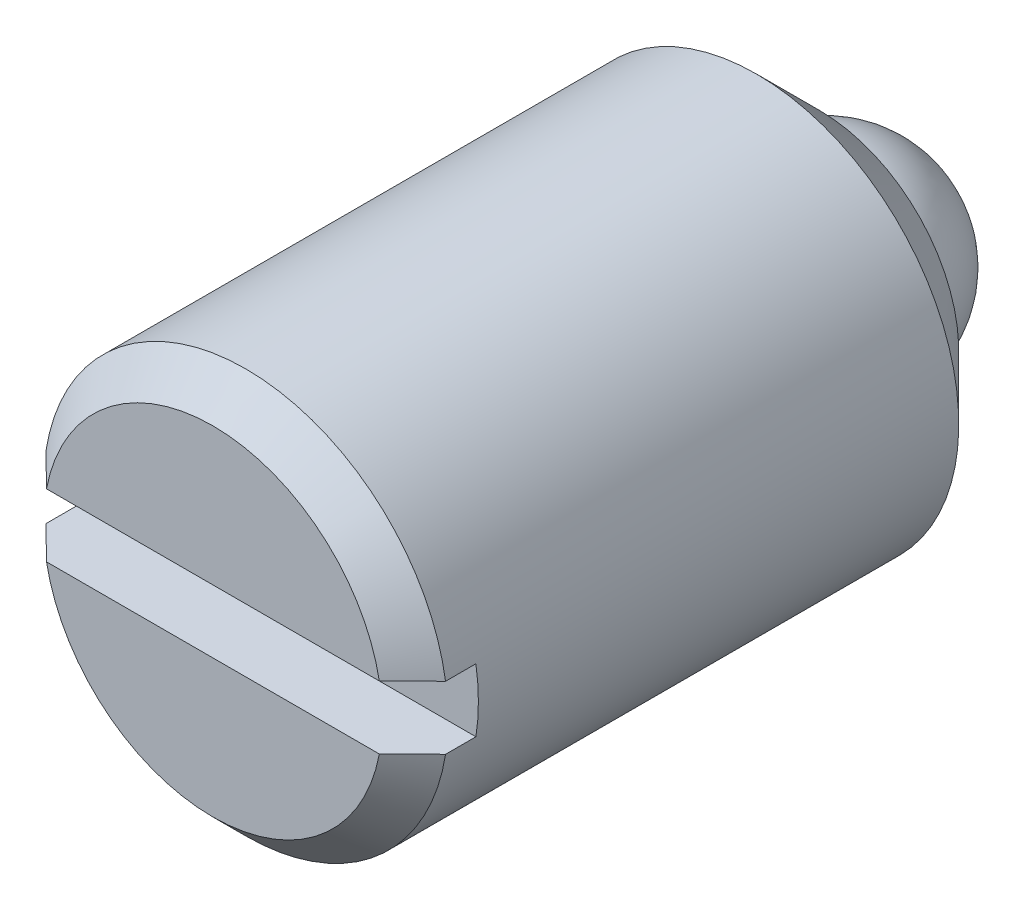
ISO-10303-21;
HEADER;
FILE_DESCRIPTION(('STEP AP214'),'2;1');
FILE_NAME('part.step','',(''),(''),'','','');
FILE_SCHEMA(('AUTOMOTIVE_DESIGN { 1 0 10303 214 1 1 1 1 }'));
ENDSEC;
DATA;
#1=APPLICATION_CONTEXT('core data for automotive mechanical design processes');
#2=APPLICATION_PROTOCOL_DEFINITION('international standard','automotive_design',2000,#1);
#3=PRODUCT_CONTEXT('',#1,'mechanical');
#4=PRODUCT('Part','Part','',(#3));
#5=PRODUCT_RELATED_PRODUCT_CATEGORY('part','',(#4));
#6=PRODUCT_DEFINITION_FORMATION('','',#4);
#7=PRODUCT_DEFINITION_CONTEXT('part definition',#1,'design');
#8=PRODUCT_DEFINITION('design','',#6,#7);
#9=PRODUCT_DEFINITION_SHAPE('','',#8);
#10=(LENGTH_UNIT() NAMED_UNIT(*) SI_UNIT(.MILLI.,.METRE.));
#11=(NAMED_UNIT(*) PLANE_ANGLE_UNIT() SI_UNIT($,.RADIAN.));
#12=(NAMED_UNIT(*) SI_UNIT($,.STERADIAN.) SOLID_ANGLE_UNIT());
#13=UNCERTAINTY_MEASURE_WITH_UNIT(LENGTH_MEASURE(1.E-05),#10,'distance_accuracy_value','');
#14=(GEOMETRIC_REPRESENTATION_CONTEXT(3) GLOBAL_UNCERTAINTY_ASSIGNED_CONTEXT((#13)) GLOBAL_UNIT_ASSIGNED_CONTEXT((#10,
#11,#12)) REPRESENTATION_CONTEXT('',''));
#15=CARTESIAN_POINT('',(0.,0.,0.));
#16=DIRECTION('',(0.,0.,1.));
#17=DIRECTION('',(1.,0.,0.));
#18=AXIS2_PLACEMENT_3D('',#15,#16,#17);
#19=CARTESIAN_POINT('',(0.,8.,28.5));
#20=DIRECTION('',(0.,0.,1.));
#21=DIRECTION('',(1.,0.,0.));
#22=AXIS2_PLACEMENT_3D('',#19,#20,#21);
#23=PLANE('',#22);
#24=DIRECTION('',(1.,0.,0.));
#25=VECTOR('',#24,1.);
#26=CARTESIAN_POINT('',(-7.90174031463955,1.25,28.5));
#27=LINE('',#26,#25);
#28=CARTESIAN_POINT('',(-6.5823627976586,1.25,28.5));
#29=VERTEX_POINT('',#28);
#30=CARTESIAN_POINT('',(6.5823627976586,1.25,28.5));
#31=VERTEX_POINT('',#30);
#32=EDGE_CURVE('E86',#29,#31,#27,.T.);
#33=ORIENTED_EDGE('',*,*,#32,.T.);
#34=CARTESIAN_POINT('',(0.,0.,28.5));
#35=DIRECTION('',(0.,0.,1.));
#36=DIRECTION('',(1.,0.,0.));
#37=AXIS2_PLACEMENT_3D('',#34,#35,#36);
#38=CIRCLE('',#37,6.7);
#39=EDGE_CURVE('E160',#31,#29,#38,.T.);
#40=ORIENTED_EDGE('',*,*,#39,.T.);
#41=EDGE_LOOP('',(#33,#40));
#42=FACE_BOUND('',#41,.T.);
#43=ADVANCED_FACE('F14',(#42),#23,.T.);
#44=CARTESIAN_POINT('',(0.,0.,-3.5));
#45=DIRECTION('',(0.,0.,-1.));
#46=DIRECTION('',(-1.,0.,0.));
#47=AXIS2_PLACEMENT_3D('',#44,#45,#46);
#48=CYLINDRICAL_SURFACE('',#47,8.);
#49=DIRECTION('',(0.,0.,1.));
#50=VECTOR('',#49,1.);
#51=CARTESIAN_POINT('',(7.90174031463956,-1.25,26.5));
#52=LINE('',#51,#50);
#53=CARTESIAN_POINT('',(7.90174031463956,-1.25,26.));
#54=VERTEX_POINT('',#53);
#55=CARTESIAN_POINT('',(7.90174031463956,-1.25,27.2));
#56=VERTEX_POINT('',#55);
#57=EDGE_CURVE('E85',#54,#56,#52,.T.);
#58=ORIENTED_EDGE('',*,*,#57,.T.);
#59=CARTESIAN_POINT('',(0.,0.,27.2));
#60=DIRECTION('',(0.,0.,1.));
#61=DIRECTION('',(1.,0.,0.));
#62=AXIS2_PLACEMENT_3D('',#59,#60,#61);
#63=CIRCLE('',#62,8.);
#64=CARTESIAN_POINT('',(-7.90174031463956,-1.25,27.2));
#65=VERTEX_POINT('',#64);
#66=EDGE_CURVE('E82',#56,#65,#63,.F.);
#67=ORIENTED_EDGE('',*,*,#66,.T.);
#68=DIRECTION('',(0.,0.,1.));
#69=VECTOR('',#68,1.);
#70=CARTESIAN_POINT('',(-7.90174031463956,-1.25,26.5));
#71=LINE('',#70,#69);
#72=CARTESIAN_POINT('',(-7.90174031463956,-1.25,26.));
#73=VERTEX_POINT('',#72);
#74=EDGE_CURVE('E73',#73,#65,#71,.T.);
#75=ORIENTED_EDGE('',*,*,#74,.F.);
#76=CARTESIAN_POINT('',(0.,0.,26.));
#77=DIRECTION('',(0.,0.,1.));
#78=DIRECTION('',(0.,-1.,0.));
#79=AXIS2_PLACEMENT_3D('',#76,#77,#78);
#80=CIRCLE('',#79,8.);
#81=CARTESIAN_POINT('',(-7.90174031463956,1.25,26.));
#82=VERTEX_POINT('',#81);
#83=EDGE_CURVE('E80',#82,#73,#80,.T.);
#84=ORIENTED_EDGE('',*,*,#83,.F.);
#85=DIRECTION('',(0.,0.,1.));
#86=VECTOR('',#85,1.);
#87=CARTESIAN_POINT('',(-7.90174031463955,1.25,26.5));
#88=LINE('',#87,#86);
#89=CARTESIAN_POINT('',(-7.90174031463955,1.25,27.2));
#90=VERTEX_POINT('',#89);
#91=EDGE_CURVE('E111',#82,#90,#88,.T.);
#92=ORIENTED_EDGE('',*,*,#91,.T.);
#93=CARTESIAN_POINT('',(0.,0.,27.2));
#94=DIRECTION('',(0.,0.,1.));
#95=DIRECTION('',(1.,0.,0.));
#96=AXIS2_PLACEMENT_3D('',#93,#94,#95);
#97=CIRCLE('',#96,8.);
#98=CARTESIAN_POINT('',(7.90174031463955,1.25,27.2));
#99=VERTEX_POINT('',#98);
#100=EDGE_CURVE('E162',#90,#99,#97,.F.);
#101=ORIENTED_EDGE('',*,*,#100,.T.);
#102=DIRECTION('',(0.,0.,1.));
#103=VECTOR('',#102,1.);
#104=CARTESIAN_POINT('',(7.90174031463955,1.25,26.5));
#105=LINE('',#104,#103);
#106=CARTESIAN_POINT('',(7.90174031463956,1.25,26.));
#107=VERTEX_POINT('',#106);
#108=EDGE_CURVE('E109',#107,#99,#105,.T.);
#109=ORIENTED_EDGE('',*,*,#108,.F.);
#110=CARTESIAN_POINT('',(0.,0.,26.));
#111=DIRECTION('',(0.,0.,1.));
#112=DIRECTION('',(0.,-1.,0.));
#113=AXIS2_PLACEMENT_3D('',#110,#111,#112);
#114=CIRCLE('',#113,8.);
#115=EDGE_CURVE('E95',#54,#107,#114,.T.);
#116=ORIENTED_EDGE('',*,*,#115,.F.);
#117=EDGE_LOOP('',(#58,#67,#75,#84,#92,#101,#109,#116));
#118=FACE_BOUND('',#117,.T.);
#119=CARTESIAN_POINT('',(0.,0.,7.));
#120=DIRECTION('',(0.,0.,-1.));
#121=DIRECTION('',(0.,1.,0.));
#122=AXIS2_PLACEMENT_3D('',#119,#120,#121);
#123=CIRCLE('',#122,8.);
#124=CARTESIAN_POINT('',(0.,8.,7.));
#125=VERTEX_POINT('',#124);
#126=EDGE_CURVE('E122',#125,#125,#123,.F.);
#127=ORIENTED_EDGE('',*,*,#126,.T.);
#128=EDGE_LOOP('',(#127));
#129=FACE_BOUND('',#128,.T.);
#130=ADVANCED_FACE('F76',(#118,#129),#48,.T.);
#131=CARTESIAN_POINT('',(0.,4.25,4.5));
#132=DIRECTION('',(0.,0.,-1.));
#133=DIRECTION('',(-1.,0.,0.));
#134=AXIS2_PLACEMENT_3D('',#131,#132,#133);
#135=PLANE('',#134);
#136=CARTESIAN_POINT('',(0.,0.,4.5));
#137=DIRECTION('',(0.,0.,-1.));
#138=DIRECTION('',(0.,1.,0.));
#139=AXIS2_PLACEMENT_3D('',#136,#137,#138);
#140=CIRCLE('',#139,5.5);
#141=CARTESIAN_POINT('',(0.,5.5,4.5));
#142=VERTEX_POINT('',#141);
#143=EDGE_CURVE('E119',#142,#142,#140,.T.);
#144=ORIENTED_EDGE('',*,*,#143,.T.);
#145=EDGE_LOOP('',(#144));
#146=FACE_BOUND('',#145,.T.);
#147=CARTESIAN_POINT('',(0.,0.,4.5));
#148=DIRECTION('',(0.,0.,-1.));
#149=DIRECTION('',(-1.,0.,0.));
#150=AXIS2_PLACEMENT_3D('',#147,#148,#149);
#151=CIRCLE('',#150,4.25);
#152=CARTESIAN_POINT('',(-4.25,0.,4.5));
#153=VERTEX_POINT('',#152);
#154=EDGE_CURVE('E116',#153,#153,#151,.T.);
#155=ORIENTED_EDGE('',*,*,#154,.F.);
#156=EDGE_LOOP('',(#155));
#157=FACE_BOUND('',#156,.T.);
#158=ADVANCED_FACE('F183',(#146,#157),#135,.T.);
#159=CARTESIAN_POINT('',(0.,0.,-3.5));
#160=DIRECTION('',(0.,0.,-1.));
#161=DIRECTION('',(-1.,0.,0.));
#162=AXIS2_PLACEMENT_3D('',#159,#160,#161);
#163=CYLINDRICAL_SURFACE('',#162,4.25);
#164=CARTESIAN_POINT('',(0.,0.,4.25));
#165=DIRECTION('',(0.,0.,-1.));
#166=DIRECTION('',(-1.,0.,0.));
#167=AXIS2_PLACEMENT_3D('',#164,#165,#166);
#168=CIRCLE('',#167,4.25);
#169=CARTESIAN_POINT('',(-4.25,0.,4.25));
#170=VERTEX_POINT('',#169);
#171=EDGE_CURVE('E113',#170,#170,#168,.T.);
#172=ORIENTED_EDGE('',*,*,#171,.F.);
#173=EDGE_LOOP('',(#172));
#174=FACE_BOUND('',#173,.T.);
#175=ORIENTED_EDGE('',*,*,#154,.T.);
#176=EDGE_LOOP('',(#175));
#177=FACE_BOUND('',#176,.T.);
#178=ADVANCED_FACE('F174',(#174,#177),#163,.T.);
#179=CARTESIAN_POINT('',(0.,0.,4.25));
#180=DIRECTION('',(-1.,0.,0.));
#181=DIRECTION('',(0.,0.,1.));
#182=AXIS2_PLACEMENT_3D('',#179,#180,#181);
#183=SPHERICAL_SURFACE('',#182,4.25);
#184=CARTESIAN_POINT('',(0.,0.,4.25));
#185=DIRECTION('',(0.,0.,-1.));
#186=DIRECTION('',(-1.,0.,0.));
#187=AXIS2_PLACEMENT_3D('',#184,#185,#186);
#188=SPHERICAL_SURFACE('',#187,4.25);
#189=ORIENTED_EDGE('',*,*,#171,.T.);
#190=EDGE_LOOP('',(#189));
#191=FACE_BOUND('',#190,.T.);
#192=ADVANCED_FACE('F168',(#191),#188,.T.);
#193=DIRECTION('',(1.,0.,0.));
#194=VECTOR('',#193,1.);
#195=CARTESIAN_POINT('',(-7.90174031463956,-1.25,28.5));
#196=LINE('',#195,#194);
#197=CARTESIAN_POINT('',(-6.58236279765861,-1.25,28.5));
#198=VERTEX_POINT('',#197);
#199=CARTESIAN_POINT('',(6.5823627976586,-1.25,28.5));
#200=VERTEX_POINT('',#199);
#201=EDGE_CURVE('E105',#198,#200,#196,.T.);
#202=ORIENTED_EDGE('',*,*,#201,.F.);
#203=CARTESIAN_POINT('',(0.,0.,28.5));
#204=DIRECTION('',(0.,0.,1.));
#205=DIRECTION('',(1.,0.,0.));
#206=AXIS2_PLACEMENT_3D('',#203,#204,#205);
#207=CIRCLE('',#206,6.7);
#208=EDGE_CURVE('E125',#198,#200,#207,.T.);
#209=ORIENTED_EDGE('',*,*,#208,.T.);
#210=EDGE_LOOP('',(#202,#209));
#211=FACE_BOUND('',#210,.T.);
#212=ADVANCED_FACE('F152',(#211),#23,.T.);
#213=CARTESIAN_POINT('',(-7.90174031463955,1.25,26.5));
#214=DIRECTION('',(0.,-1.,0.));
#215=DIRECTION('',(1.,0.,0.));
#216=AXIS2_PLACEMENT_3D('',#213,#214,#215);
#217=PLANE('',#216);
#218=ORIENTED_EDGE('',*,*,#32,.F.);
#219=CARTESIAN_POINT('',(-6.5823627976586,1.25,28.5));
#220=CARTESIAN_POINT('',(-6.69246825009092,1.25,28.3918264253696));
#221=CARTESIAN_POINT('',(-6.80252765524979,1.25,28.2836060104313));
#222=CARTESIAN_POINT('',(-7.02256440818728,1.25,28.0670818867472));
#223=CARTESIAN_POINT('',(-7.13254175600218,1.25,27.9587781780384));
#224=CARTESIAN_POINT('',(-7.46236593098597,1.25,27.6337575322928));
#225=CARTESIAN_POINT('',(-7.68210487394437,1.25,27.4169310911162));
#226=CARTESIAN_POINT('',(-7.90174031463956,1.25,27.2));
#227=B_SPLINE_CURVE_WITH_KNOTS('',3,(#219,#220,#221,#222,#223,#224,#225,#226),.UNSPECIFIED.,.F.,
.F.,(4,2,2,4),(0.,0.463057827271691,0.926115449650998,1.85223076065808),.UNSPECIFIED.);
#228=EDGE_CURVE('E9',#29,#90,#227,.T.);
#229=ORIENTED_EDGE('',*,*,#228,.T.);
#230=ORIENTED_EDGE('',*,*,#91,.F.);
#231=DIRECTION('',(-1.,0.,0.));
#232=VECTOR('',#231,1.);
#233=CARTESIAN_POINT('',(7.90174031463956,1.25,26.));
#234=LINE('',#233,#232);
#235=EDGE_CURVE('E100',#107,#82,#234,.T.);
#236=ORIENTED_EDGE('',*,*,#235,.F.);
#237=ORIENTED_EDGE('',*,*,#108,.T.);
#238=CARTESIAN_POINT('',(7.90174031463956,1.25,27.2));
#239=CARTESIAN_POINT('',(7.68210487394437,1.25,27.4169310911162));
#240=CARTESIAN_POINT('',(7.46236593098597,1.25,27.6337575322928));
#241=CARTESIAN_POINT('',(7.13254175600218,1.25,27.9587781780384));
#242=CARTESIAN_POINT('',(7.02256440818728,1.25,28.0670818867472));
#243=CARTESIAN_POINT('',(6.8025276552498,1.25,28.2836060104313));
#244=CARTESIAN_POINT('',(6.69246825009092,1.25,28.3918264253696));
#245=CARTESIAN_POINT('',(6.5823627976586,1.25,28.5));
#246=B_SPLINE_CURVE_WITH_KNOTS('',3,(#238,#239,#240,#241,#242,#243,#244,#245),.UNSPECIFIED.,.F.,
.F.,(4,2,2,4),(0.,0.92611531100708,1.38917293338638,1.85223076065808),.UNSPECIFIED.);
#247=EDGE_CURVE('E28',#99,#31,#246,.T.);
#248=ORIENTED_EDGE('',*,*,#247,.T.);
#249=EDGE_LOOP('',(#218,#229,#230,#236,#237,#248));
#250=FACE_BOUND('',#249,.T.);
#251=ADVANCED_FACE('F147',(#250),#217,.T.);
#252=CARTESIAN_POINT('',(-7.90174031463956,-1.25,26.5));
#253=DIRECTION('',(0.,-1.,0.));
#254=DIRECTION('',(1.,0.,0.));
#255=AXIS2_PLACEMENT_3D('',#252,#253,#254);
#256=PLANE('',#255);
#257=ORIENTED_EDGE('',*,*,#201,.T.);
#258=CARTESIAN_POINT('',(6.5823627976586,-1.25,28.5));
#259=CARTESIAN_POINT('',(6.69246825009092,-1.25,28.3918264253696));
#260=CARTESIAN_POINT('',(6.80252765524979,-1.25,28.2836060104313));
#261=CARTESIAN_POINT('',(7.02256440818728,-1.25,28.0670818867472));
#262=CARTESIAN_POINT('',(7.13254175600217,-1.25,27.9587781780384));
#263=CARTESIAN_POINT('',(7.46236593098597,-1.25,27.6337575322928));
#264=CARTESIAN_POINT('',(7.68210487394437,-1.25,27.4169310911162));
#265=CARTESIAN_POINT('',(7.90174031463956,-1.25,27.2));
#266=B_SPLINE_CURVE_WITH_KNOTS('',3,(#258,#259,#260,#261,#262,#263,#264,#265),.UNSPECIFIED.,.F.,
.F.,(4,2,2,4),(0.,0.463057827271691,0.926115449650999,1.85223076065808),.UNSPECIFIED.);
#267=EDGE_CURVE('E135',#200,#56,#266,.T.);
#268=ORIENTED_EDGE('',*,*,#267,.T.);
#269=ORIENTED_EDGE('',*,*,#57,.F.);
#270=DIRECTION('',(1.,0.,0.));
#271=VECTOR('',#270,1.);
#272=CARTESIAN_POINT('',(-7.90174031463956,-1.25,26.));
#273=LINE('',#272,#271);
#274=EDGE_CURVE('E89',#73,#54,#273,.T.);
#275=ORIENTED_EDGE('',*,*,#274,.F.);
#276=ORIENTED_EDGE('',*,*,#74,.T.);
#277=CARTESIAN_POINT('',(-7.90174031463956,-1.25,27.2));
#278=CARTESIAN_POINT('',(-7.68210487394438,-1.25,27.4169310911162));
#279=CARTESIAN_POINT('',(-7.46236593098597,-1.25,27.6337575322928));
#280=CARTESIAN_POINT('',(-7.13254175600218,-1.25,27.9587781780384));
#281=CARTESIAN_POINT('',(-7.02256440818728,-1.25,28.0670818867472));
#282=CARTESIAN_POINT('',(-6.8025276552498,-1.25,28.2836060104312));
#283=CARTESIAN_POINT('',(-6.69246825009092,-1.25,28.3918264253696));
#284=CARTESIAN_POINT('',(-6.58236279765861,-1.25,28.5));
#285=B_SPLINE_CURVE_WITH_KNOTS('',3,(#277,#278,#279,#280,#281,#282,#283,#284),.UNSPECIFIED.,.F.,
.F.,(4,2,2,4),(0.,0.926115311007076,1.38917293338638,1.85223076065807),.UNSPECIFIED.);
#286=EDGE_CURVE('E128',#65,#198,#285,.T.);
#287=ORIENTED_EDGE('',*,*,#286,.T.);
#288=EDGE_LOOP('',(#257,#268,#269,#275,#276,#287));
#289=FACE_BOUND('',#288,.T.);
#290=ADVANCED_FACE('F91',(#289),#256,.F.);
#291=CARTESIAN_POINT('',(0.,0.,26.));
#292=DIRECTION('',(0.,0.,1.));
#293=DIRECTION('',(0.,-1.,0.));
#294=AXIS2_PLACEMENT_3D('',#291,#292,#293);
#295=PLANE('',#294);
#296=ORIENTED_EDGE('',*,*,#83,.T.);
#297=ORIENTED_EDGE('',*,*,#274,.T.);
#298=ORIENTED_EDGE('',*,*,#115,.T.);
#299=ORIENTED_EDGE('',*,*,#235,.T.);
#300=EDGE_LOOP('',(#296,#297,#298,#299));
#301=FACE_BOUND('',#300,.T.);
#302=ADVANCED_FACE('F98',(#301),#295,.T.);
#303=CARTESIAN_POINT('',(0.,0.,4.5));
#304=DIRECTION('',(0.,0.,1.));
#305=DIRECTION('',(0.,-1.,0.));
#306=AXIS2_PLACEMENT_3D('',#303,#304,#305);
#307=CONICAL_SURFACE('',#306,5.5,0.785398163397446);
#308=ORIENTED_EDGE('',*,*,#126,.F.);
#309=EDGE_LOOP('',(#308));
#310=FACE_BOUND('',#309,.T.);
#311=ORIENTED_EDGE('',*,*,#143,.F.);
#312=EDGE_LOOP('',(#311));
#313=FACE_BOUND('',#312,.T.);
#314=ADVANCED_FACE('F189',(#310,#313),#307,.T.);
#315=CARTESIAN_POINT('',(0.,0.,28.5));
#316=DIRECTION('',(0.,0.,-1.));
#317=DIRECTION('',(-1.,0.,0.));
#318=AXIS2_PLACEMENT_3D('',#315,#316,#317);
#319=CONICAL_SURFACE('',#318,6.7,0.785398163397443);
#320=ORIENTED_EDGE('',*,*,#286,.F.);
#321=ORIENTED_EDGE('',*,*,#66,.F.);
#322=ORIENTED_EDGE('',*,*,#267,.F.);
#323=ORIENTED_EDGE('',*,*,#208,.F.);
#324=EDGE_LOOP('',(#320,#321,#322,#323));
#325=FACE_BOUND('',#324,.T.);
#326=ADVANCED_FACE('F141',(#325),#319,.T.);
#327=CARTESIAN_POINT('',(0.,0.,28.5));
#328=DIRECTION('',(0.,0.,-1.));
#329=DIRECTION('',(-1.,0.,0.));
#330=AXIS2_PLACEMENT_3D('',#327,#328,#329);
#331=CONICAL_SURFACE('',#330,6.7,0.785398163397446);
#332=ORIENTED_EDGE('',*,*,#247,.F.);
#333=ORIENTED_EDGE('',*,*,#100,.F.);
#334=ORIENTED_EDGE('',*,*,#228,.F.);
#335=ORIENTED_EDGE('',*,*,#39,.F.);
#336=EDGE_LOOP('',(#332,#333,#334,#335));
#337=FACE_BOUND('',#336,.T.);
#338=ADVANCED_FACE('F16',(#337),#331,.T.);
#339=CLOSED_SHELL('',(#43,#130,#158,#178,#192,#212,#251,#290,#302,#314,#326,#338));
#340=MANIFOLD_SOLID_BREP('B1',#339);
#341=ADVANCED_BREP_SHAPE_REPRESENTATION('',(#18,#340),#14);
#342=SHAPE_DEFINITION_REPRESENTATION(#9,#341);
ENDSEC;
END-ISO-10303-21;
